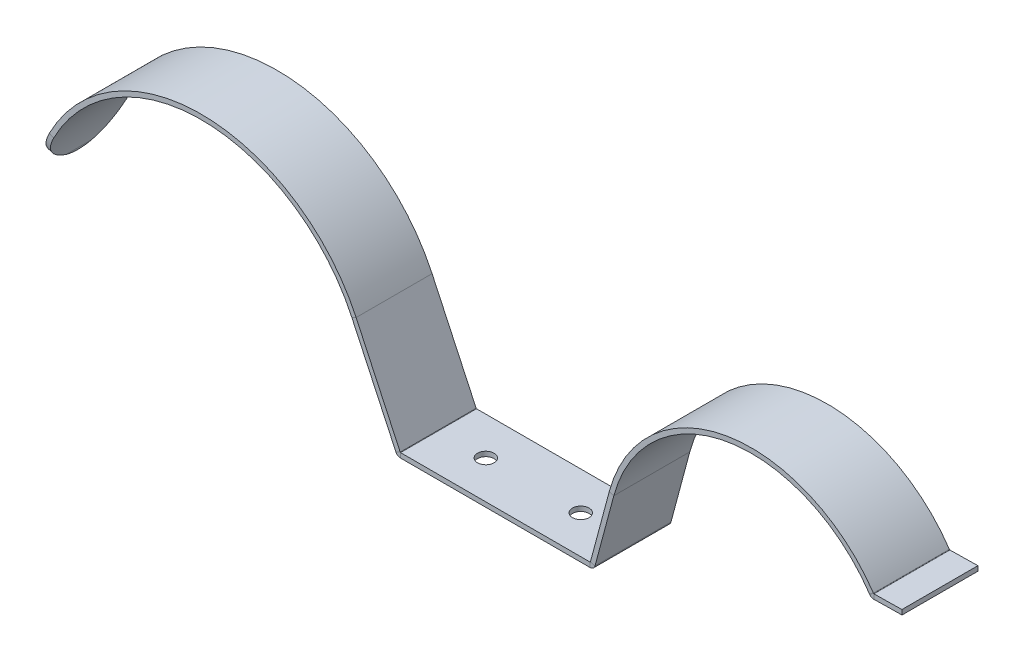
ISO-10303-21;
HEADER;
FILE_DESCRIPTION(('STEP AP214'),'2;1');
FILE_NAME('part.step','',(''),(''),'','','');
FILE_SCHEMA(('AUTOMOTIVE_DESIGN { 1 0 10303 214 1 1 1 1 }'));
ENDSEC;
DATA;
#1=APPLICATION_CONTEXT('core data for automotive mechanical design processes');
#2=APPLICATION_PROTOCOL_DEFINITION('international standard','automotive_design',2000,#1);
#3=PRODUCT_CONTEXT('',#1,'mechanical');
#4=PRODUCT('Part','Part','',(#3));
#5=PRODUCT_RELATED_PRODUCT_CATEGORY('part','',(#4));
#6=PRODUCT_DEFINITION_FORMATION('','',#4);
#7=PRODUCT_DEFINITION_CONTEXT('part definition',#1,'design');
#8=PRODUCT_DEFINITION('design','',#6,#7);
#9=PRODUCT_DEFINITION_SHAPE('','',#8);
#10=(LENGTH_UNIT() NAMED_UNIT(*) SI_UNIT(.MILLI.,.METRE.));
#11=(NAMED_UNIT(*) PLANE_ANGLE_UNIT() SI_UNIT($,.RADIAN.));
#12=(NAMED_UNIT(*) SI_UNIT($,.STERADIAN.) SOLID_ANGLE_UNIT());
#13=UNCERTAINTY_MEASURE_WITH_UNIT(LENGTH_MEASURE(1.E-05),#10,'distance_accuracy_value','');
#14=(GEOMETRIC_REPRESENTATION_CONTEXT(3) GLOBAL_UNCERTAINTY_ASSIGNED_CONTEXT((#13)) GLOBAL_UNIT_ASSIGNED_CONTEXT((#10,
#11,#12)) REPRESENTATION_CONTEXT('',''));
#15=CARTESIAN_POINT('',(0.,0.,0.));
#16=DIRECTION('',(0.,0.,1.));
#17=DIRECTION('',(1.,0.,0.));
#18=AXIS2_PLACEMENT_3D('',#15,#16,#17);
#19=CARTESIAN_POINT('',(56.8219387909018,91.2144847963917,-8.));
#20=DIRECTION('',(0.906307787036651,0.422618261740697,0.));
#21=DIRECTION('',(0.,0.,1.));
#22=AXIS2_PLACEMENT_3D('',#19,#20,#21);
#23=PLANE('',#22);
#24=DIRECTION('',(0.422618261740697,-0.906307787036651,0.));
#25=VECTOR('',#24,1.);
#26=CARTESIAN_POINT('',(56.8219387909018,91.2144847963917,0.));
#27=LINE('',#26,#25);
#28=CARTESIAN_POINT('',(89.7775014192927,20.5410526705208,0.));
#29=VERTEX_POINT('',#28);
#30=CARTESIAN_POINT('',(99.0597903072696,0.63511991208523,0.));
#31=VERTEX_POINT('',#30);
#32=EDGE_CURVE('E421',#29,#31,#27,.T.);
#33=ORIENTED_EDGE('',*,*,#32,.F.);
#34=DIRECTION('',(0.,0.,-1.));
#35=VECTOR('',#34,1.);
#36=CARTESIAN_POINT('',(89.7775014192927,20.5410526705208,-8.));
#37=LINE('',#36,#35);
#38=CARTESIAN_POINT('',(89.7775014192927,20.5410526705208,-16.));
#39=VERTEX_POINT('',#38);
#40=EDGE_CURVE('E76',#29,#39,#37,.T.);
#41=ORIENTED_EDGE('',*,*,#40,.T.);
#42=DIRECTION('',(-0.422618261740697,0.906307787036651,0.));
#43=VECTOR('',#42,1.);
#44=CARTESIAN_POINT('',(56.8219387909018,91.2144847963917,-16.));
#45=LINE('',#44,#43);
#46=CARTESIAN_POINT('',(99.0597903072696,0.63511991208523,-16.));
#47=VERTEX_POINT('',#46);
#48=EDGE_CURVE('E426',#47,#39,#45,.T.);
#49=ORIENTED_EDGE('',*,*,#48,.F.);
#50=DIRECTION('',(0.,0.,1.));
#51=VECTOR('',#50,1.);
#52=CARTESIAN_POINT('',(99.0597903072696,0.63511991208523,-8.));
#53=LINE('',#52,#51);
#54=EDGE_CURVE('E423',#47,#31,#53,.T.);
#55=ORIENTED_EDGE('',*,*,#54,.T.);
#56=EDGE_LOOP('',(#33,#41,#49,#55));
#57=FACE_BOUND('',#56,.T.);
#58=ADVANCED_FACE('F66',(#57),#23,.F.);
#59=CARTESIAN_POINT('',(57.7282465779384,91.6371030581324,0.));
#60=DIRECTION('',(0.,0.,-1.));
#61=DIRECTION('',(-0.422618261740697,0.906307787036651,0.));
#62=AXIS2_PLACEMENT_3D('',#59,#60,#61);
#63=PLANE('',#62);
#64=DIRECTION('',(0.422618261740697,-0.906307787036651,0.));
#65=VECTOR('',#64,1.);
#66=CARTESIAN_POINT('',(57.7282465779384,91.6371030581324,0.));
#67=LINE('',#66,#65);
#68=CARTESIAN_POINT('',(90.6838092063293,20.9636709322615,0.));
#69=VERTEX_POINT('',#68);
#70=CARTESIAN_POINT('',(99.9660980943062,1.05773817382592,0.));
#71=VERTEX_POINT('',#70);
#72=EDGE_CURVE('E430',#69,#71,#67,.T.);
#73=ORIENTED_EDGE('',*,*,#72,.F.);
#74=DIRECTION('',(-0.906307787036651,-0.422618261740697,0.));
#75=VECTOR('',#74,1.);
#76=CARTESIAN_POINT('',(90.6838092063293,20.9636709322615,0.));
#77=LINE('',#76,#75);
#78=EDGE_CURVE('E12',#69,#29,#77,.T.);
#79=ORIENTED_EDGE('',*,*,#78,.T.);
#80=ORIENTED_EDGE('',*,*,#32,.T.);
#81=DIRECTION('',(0.906307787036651,0.422618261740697,0.));
#82=VECTOR('',#81,1.);
#83=CARTESIAN_POINT('',(99.9660980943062,1.05773817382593,0.));
#84=LINE('',#83,#82);
#85=EDGE_CURVE('E461',#31,#71,#84,.T.);
#86=ORIENTED_EDGE('',*,*,#85,.T.);
#87=EDGE_LOOP('',(#73,#79,#80,#86));
#88=FACE_BOUND('',#87,.T.);
#89=ADVANCED_FACE('F410',(#88),#63,.F.);
#90=CARTESIAN_POINT('',(57.7282465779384,91.6371030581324,-16.));
#91=DIRECTION('',(0.,0.,1.));
#92=DIRECTION('',(0.422618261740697,-0.906307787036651,0.));
#93=AXIS2_PLACEMENT_3D('',#90,#91,#92);
#94=PLANE('',#93);
#95=ORIENTED_EDGE('',*,*,#48,.T.);
#96=DIRECTION('',(0.906307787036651,0.422618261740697,0.));
#97=VECTOR('',#96,1.);
#98=CARTESIAN_POINT('',(90.6838092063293,20.9636709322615,-16.));
#99=LINE('',#98,#97);
#100=CARTESIAN_POINT('',(90.6838092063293,20.9636709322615,-16.));
#101=VERTEX_POINT('',#100);
#102=EDGE_CURVE('E441',#39,#101,#99,.T.);
#103=ORIENTED_EDGE('',*,*,#102,.T.);
#104=DIRECTION('',(-0.422618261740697,0.906307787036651,0.));
#105=VECTOR('',#104,1.);
#106=CARTESIAN_POINT('',(57.7282465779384,91.6371030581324,-16.));
#107=LINE('',#106,#105);
#108=CARTESIAN_POINT('',(99.9660980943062,1.05773817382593,-16.));
#109=VERTEX_POINT('',#108);
#110=EDGE_CURVE('E439',#109,#101,#107,.T.);
#111=ORIENTED_EDGE('',*,*,#110,.F.);
#112=DIRECTION('',(-0.906307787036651,-0.422618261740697,0.));
#113=VECTOR('',#112,1.);
#114=CARTESIAN_POINT('',(99.9660980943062,1.05773817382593,-16.));
#115=LINE('',#114,#113);
#116=EDGE_CURVE('E473',#109,#47,#115,.T.);
#117=ORIENTED_EDGE('',*,*,#116,.T.);
#118=EDGE_LOOP('',(#95,#103,#111,#117));
#119=FACE_BOUND('',#118,.T.);
#120=ADVANCED_FACE('F415',(#119),#94,.F.);
#121=CARTESIAN_POINT('',(74.4000738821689,210.831515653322,-16.));
#122=DIRECTION('',(0.,0.,1.));
#123=DIRECTION('',(0.559192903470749,-0.829037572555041,0.));
#124=AXIS2_PLACEMENT_3D('',#121,#122,#123);
#125=PLANE('',#124);
#126=DIRECTION('',(-0.559192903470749,0.829037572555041,0.));
#127=VECTOR('',#126,1.);
#128=CARTESIAN_POINT('',(74.4000738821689,210.831515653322,-16.));
#129=LINE('',#128,#127);
#130=CARTESIAN_POINT('',(199.659284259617,25.1270994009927,-16.0000000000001));
#131=VERTEX_POINT('',#130);
#132=CARTESIAN_POINT('',(199.634708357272,25.1635346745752,-16.0000000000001));
#133=VERTEX_POINT('',#132);
#134=EDGE_CURVE('E449',#131,#133,#129,.T.);
#135=ORIENTED_EDGE('',*,*,#134,.F.);
#136=DIRECTION('',(-0.82903757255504,-0.559192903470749,0.));
#137=VECTOR('',#136,1.);
#138=CARTESIAN_POINT('',(199.659284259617,25.1270994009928,-16.0000000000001));
#139=LINE('',#138,#137);
#140=CARTESIAN_POINT('',(198.830246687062,24.567906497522,-16.0000000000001));
#141=VERTEX_POINT('',#140);
#142=EDGE_CURVE('E442',#131,#141,#139,.T.);
#143=ORIENTED_EDGE('',*,*,#142,.T.);
#144=DIRECTION('',(-0.559192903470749,0.829037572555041,0.));
#145=VECTOR('',#144,1.);
#146=CARTESIAN_POINT('',(73.5710363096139,210.272322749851,-16.));
#147=LINE('',#146,#145);
#148=CARTESIAN_POINT('',(198.805670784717,24.6043417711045,-16.0000000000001));
#149=VERTEX_POINT('',#148);
#150=EDGE_CURVE('E530',#141,#149,#147,.T.);
#151=ORIENTED_EDGE('',*,*,#150,.T.);
#152=DIRECTION('',(0.829037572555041,0.559192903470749,0.));
#153=VECTOR('',#152,1.);
#154=CARTESIAN_POINT('',(199.634708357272,25.1635346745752,-16.0000000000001));
#155=LINE('',#154,#153);
#156=EDGE_CURVE('E532',#149,#133,#155,.T.);
#157=ORIENTED_EDGE('',*,*,#156,.T.);
#158=EDGE_LOOP('',(#135,#143,#151,#157));
#159=FACE_BOUND('',#158,.T.);
#160=ADVANCED_FACE('F699',(#159),#125,.F.);
#161=CARTESIAN_POINT('',(73.5710363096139,210.272322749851,-8.));
#162=DIRECTION('',(0.829037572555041,0.559192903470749,0.));
#163=DIRECTION('',(0.,0.,1.));
#164=AXIS2_PLACEMENT_3D('',#161,#162,#163);
#165=PLANE('',#164);
#166=ORIENTED_EDGE('',*,*,#150,.F.);
#167=DIRECTION('',(0.,0.,1.));
#168=VECTOR('',#167,1.);
#169=CARTESIAN_POINT('',(198.830246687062,24.567906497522,-8.));
#170=LINE('',#169,#168);
#171=CARTESIAN_POINT('',(198.830246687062,24.5679064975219,0.));
#172=VERTEX_POINT('',#171);
#173=EDGE_CURVE('E446',#141,#172,#170,.T.);
#174=ORIENTED_EDGE('',*,*,#173,.T.);
#175=DIRECTION('',(0.559192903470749,-0.829037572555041,0.));
#176=VECTOR('',#175,1.);
#177=CARTESIAN_POINT('',(73.5710363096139,210.272322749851,0.));
#178=LINE('',#177,#176);
#179=CARTESIAN_POINT('',(198.805670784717,24.6043417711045,0.));
#180=VERTEX_POINT('',#179);
#181=EDGE_CURVE('E534',#180,#172,#178,.T.);
#182=ORIENTED_EDGE('',*,*,#181,.F.);
#183=DIRECTION('',(0.,0.,-1.));
#184=VECTOR('',#183,1.);
#185=CARTESIAN_POINT('',(198.805670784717,24.6043417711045,-8.));
#186=LINE('',#185,#184);
#187=EDGE_CURVE('E533',#180,#149,#186,.T.);
#188=ORIENTED_EDGE('',*,*,#187,.T.);
#189=EDGE_LOOP('',(#166,#174,#182,#188));
#190=FACE_BOUND('',#189,.T.);
#191=ADVANCED_FACE('F695',(#190),#165,.F.);
#192=CARTESIAN_POINT('',(74.4000738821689,210.831515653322,0.));
#193=DIRECTION('',(0.,0.,-1.));
#194=DIRECTION('',(-0.559192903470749,0.829037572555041,0.));
#195=AXIS2_PLACEMENT_3D('',#192,#193,#194);
#196=PLANE('',#195);
#197=ORIENTED_EDGE('',*,*,#181,.T.);
#198=DIRECTION('',(0.82903757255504,0.559192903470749,0.));
#199=VECTOR('',#198,1.);
#200=CARTESIAN_POINT('',(199.659284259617,25.1270994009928,0.));
#201=LINE('',#200,#199);
#202=CARTESIAN_POINT('',(199.659284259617,25.1270994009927,0.));
#203=VERTEX_POINT('',#202);
#204=EDGE_CURVE('E525',#172,#203,#201,.T.);
#205=ORIENTED_EDGE('',*,*,#204,.T.);
#206=DIRECTION('',(0.559192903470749,-0.829037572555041,0.));
#207=VECTOR('',#206,1.);
#208=CARTESIAN_POINT('',(74.4000738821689,210.831515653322,0.));
#209=LINE('',#208,#207);
#210=CARTESIAN_POINT('',(199.634708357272,25.1635346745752,0.));
#211=VERTEX_POINT('',#210);
#212=EDGE_CURVE('E537',#211,#203,#209,.T.);
#213=ORIENTED_EDGE('',*,*,#212,.F.);
#214=DIRECTION('',(-0.829037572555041,-0.559192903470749,0.));
#215=VECTOR('',#214,1.);
#216=CARTESIAN_POINT('',(199.634708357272,25.1635346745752,0.));
#217=LINE('',#216,#215);
#218=EDGE_CURVE('E536',#211,#180,#217,.T.);
#219=ORIENTED_EDGE('',*,*,#218,.T.);
#220=EDGE_LOOP('',(#197,#205,#213,#219));
#221=FACE_BOUND('',#220,.T.);
#222=ADVANCED_FACE('F676',(#221),#196,.F.);
#223=CARTESIAN_POINT('',(103.779528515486,-134.218723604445,-8.));
#224=DIRECTION('',(-0.965925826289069,0.258819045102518,0.));
#225=DIRECTION('',(0.,0.,1.));
#226=AXIS2_PLACEMENT_3D('',#223,#224,#225);
#227=PLANE('',#226);
#228=DIRECTION('',(0.258819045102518,0.965925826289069,0.));
#229=VECTOR('',#228,1.);
#230=CARTESIAN_POINT('',(103.779528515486,-134.218723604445,0.));
#231=LINE('',#230,#229);
#232=CARTESIAN_POINT('',(140.031136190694,1.07411809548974,0.));
#233=VERTEX_POINT('',#232);
#234=CARTESIAN_POINT('',(143.990842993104,15.85194506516,0.));
#235=VERTEX_POINT('',#234);
#236=EDGE_CURVE('E518',#233,#235,#231,.T.);
#237=ORIENTED_EDGE('',*,*,#236,.T.);
#238=DIRECTION('',(0.,0.,-1.));
#239=VECTOR('',#238,1.);
#240=CARTESIAN_POINT('',(143.990842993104,15.8519450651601,-8.));
#241=LINE('',#240,#239);
#242=CARTESIAN_POINT('',(143.990842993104,15.8519450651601,-16.));
#243=VERTEX_POINT('',#242);
#244=EDGE_CURVE('E487',#235,#243,#241,.T.);
#245=ORIENTED_EDGE('',*,*,#244,.T.);
#246=DIRECTION('',(-0.258819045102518,-0.965925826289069,0.));
#247=VECTOR('',#246,1.);
#248=CARTESIAN_POINT('',(103.779528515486,-134.218723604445,-16.));
#249=LINE('',#248,#247);
#250=CARTESIAN_POINT('',(140.031136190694,1.07411809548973,-16.));
#251=VERTEX_POINT('',#250);
#252=EDGE_CURVE('E519',#243,#251,#249,.T.);
#253=ORIENTED_EDGE('',*,*,#252,.T.);
#254=DIRECTION('',(0.,0.,1.));
#255=VECTOR('',#254,1.);
#256=CARTESIAN_POINT('',(140.031136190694,1.07411809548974,-8.));
#257=LINE('',#256,#255);
#258=EDGE_CURVE('E521',#251,#233,#257,.T.);
#259=ORIENTED_EDGE('',*,*,#258,.T.);
#260=EDGE_LOOP('',(#237,#245,#253,#259));
#261=FACE_BOUND('',#260,.T.);
#262=ADVANCED_FACE('F645',(#261),#227,.T.);
#263=CARTESIAN_POINT('',(0.,1.,-16.));
#264=DIRECTION('',(0.,0.,1.));
#265=DIRECTION('',(1.,0.,0.));
#266=AXIS2_PLACEMENT_3D('',#263,#264,#265);
#267=PLANE('',#266);
#268=DIRECTION('',(-1.,0.,0.));
#269=VECTOR('',#268,1.);
#270=CARTESIAN_POINT('',(0.,1.,-16.));
#271=LINE('',#270,#269);
#272=CARTESIAN_POINT('',(139.934543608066,1.,-16.));
#273=VERTEX_POINT('',#272);
#274=CARTESIAN_POINT('',(100.05672887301,1.,-16.));
#275=VERTEX_POINT('',#274);
#276=EDGE_CURVE('E498',#273,#275,#271,.T.);
#277=ORIENTED_EDGE('',*,*,#276,.F.);
#278=DIRECTION('',(0.,-1.,0.));
#279=VECTOR('',#278,1.);
#280=CARTESIAN_POINT('',(139.934543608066,1.,-16.0000000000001));
#281=LINE('',#280,#279);
#282=CARTESIAN_POINT('',(139.934543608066,0.,-16.0000000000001));
#283=VERTEX_POINT('',#282);
#284=EDGE_CURVE('E484',#273,#283,#281,.T.);
#285=ORIENTED_EDGE('',*,*,#284,.T.);
#286=DIRECTION('',(-1.,0.,0.));
#287=VECTOR('',#286,1.);
#288=CARTESIAN_POINT('',(0.,0.,-16.));
#289=LINE('',#288,#287);
#290=CARTESIAN_POINT('',(100.05672887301,0.,-16.));
#291=VERTEX_POINT('',#290);
#292=EDGE_CURVE('E427',#283,#291,#289,.T.);
#293=ORIENTED_EDGE('',*,*,#292,.T.);
#294=DIRECTION('',(0.,-1.,0.));
#295=VECTOR('',#294,1.);
#296=CARTESIAN_POINT('',(100.05672887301,1.,-16.));
#297=LINE('',#296,#295);
#298=EDGE_CURVE('E469',#275,#291,#297,.T.);
#299=ORIENTED_EDGE('',*,*,#298,.F.);
#300=EDGE_LOOP('',(#277,#285,#293,#299));
#301=FACE_BOUND('',#300,.T.);
#302=ADVANCED_FACE('F632',(#301),#267,.F.);
#303=CARTESIAN_POINT('',(0.,0.,-8.));
#304=DIRECTION('',(0.,1.,0.));
#305=DIRECTION('',(0.,0.,1.));
#306=AXIS2_PLACEMENT_3D('',#303,#304,#305);
#307=PLANE('',#306);
#308=CARTESIAN_POINT('',(130.,0.,-8.00000000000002));
#309=DIRECTION('',(0.,1.,0.));
#310=DIRECTION('',(0.,0.,1.));
#311=AXIS2_PLACEMENT_3D('',#308,#309,#310);
#312=CIRCLE('',#311,1.75000000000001);
#313=CARTESIAN_POINT('',(130.,0.,-6.25000000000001));
#314=VERTEX_POINT('',#313);
#315=EDGE_CURVE('E489',#314,#314,#312,.T.);
#316=ORIENTED_EDGE('',*,*,#315,.T.);
#317=EDGE_LOOP('',(#316));
#318=FACE_BOUND('',#317,.T.);
#319=CARTESIAN_POINT('',(110.,0.,-8.00000000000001));
#320=DIRECTION('',(0.,1.,0.));
#321=DIRECTION('',(0.,0.,1.));
#322=AXIS2_PLACEMENT_3D('',#319,#320,#321);
#323=CIRCLE('',#322,1.75);
#324=CARTESIAN_POINT('',(110.,0.,-6.25000000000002));
#325=VERTEX_POINT('',#324);
#326=EDGE_CURVE('E493',#325,#325,#323,.T.);
#327=ORIENTED_EDGE('',*,*,#326,.T.);
#328=EDGE_LOOP('',(#327));
#329=FACE_BOUND('',#328,.T.);
#330=ORIENTED_EDGE('',*,*,#292,.F.);
#331=DIRECTION('',(0.,0.,1.));
#332=VECTOR('',#331,1.);
#333=CARTESIAN_POINT('',(139.934543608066,0.,-8.));
#334=LINE('',#333,#332);
#335=CARTESIAN_POINT('',(139.934543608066,0.,0.));
#336=VERTEX_POINT('',#335);
#337=EDGE_CURVE('E481',#283,#336,#334,.T.);
#338=ORIENTED_EDGE('',*,*,#337,.T.);
#339=DIRECTION('',(1.,0.,0.));
#340=VECTOR('',#339,1.);
#341=CARTESIAN_POINT('',(0.,0.,0.));
#342=LINE('',#341,#340);
#343=CARTESIAN_POINT('',(100.05672887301,0.,0.));
#344=VERTEX_POINT('',#343);
#345=EDGE_CURVE('E490',#344,#336,#342,.T.);
#346=ORIENTED_EDGE('',*,*,#345,.F.);
#347=DIRECTION('',(0.,0.,1.));
#348=VECTOR('',#347,1.);
#349=CARTESIAN_POINT('',(100.05672887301,0.,-8.));
#350=LINE('',#349,#348);
#351=EDGE_CURVE('E608',#291,#344,#350,.T.);
#352=ORIENTED_EDGE('',*,*,#351,.F.);
#353=EDGE_LOOP('',(#330,#338,#346,#352));
#354=FACE_BOUND('',#353,.T.);
#355=ADVANCED_FACE('F661',(#318,#329,#354),#307,.F.);
#356=CARTESIAN_POINT('',(0.,1.,0.));
#357=DIRECTION('',(0.,0.,-1.));
#358=DIRECTION('',(-1.,0.,0.));
#359=AXIS2_PLACEMENT_3D('',#356,#357,#358);
#360=PLANE('',#359);
#361=ORIENTED_EDGE('',*,*,#345,.T.);
#362=DIRECTION('',(0.,1.,0.));
#363=VECTOR('',#362,1.);
#364=CARTESIAN_POINT('',(139.934543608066,1.,0.));
#365=LINE('',#364,#363);
#366=CARTESIAN_POINT('',(139.934543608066,1.,0.));
#367=VERTEX_POINT('',#366);
#368=EDGE_CURVE('E478',#336,#367,#365,.T.);
#369=ORIENTED_EDGE('',*,*,#368,.T.);
#370=DIRECTION('',(1.,0.,0.));
#371=VECTOR('',#370,1.);
#372=CARTESIAN_POINT('',(0.,1.,0.));
#373=LINE('',#372,#371);
#374=CARTESIAN_POINT('',(100.05672887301,1.,0.));
#375=VERTEX_POINT('',#374);
#376=EDGE_CURVE('E494',#375,#367,#373,.T.);
#377=ORIENTED_EDGE('',*,*,#376,.F.);
#378=DIRECTION('',(0.,1.,0.));
#379=VECTOR('',#378,1.);
#380=CARTESIAN_POINT('',(100.05672887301,1.,0.));
#381=LINE('',#380,#379);
#382=EDGE_CURVE('E606',#344,#375,#381,.T.);
#383=ORIENTED_EDGE('',*,*,#382,.F.);
#384=EDGE_LOOP('',(#361,#369,#377,#383));
#385=FACE_BOUND('',#384,.T.);
#386=ADVANCED_FACE('F659',(#385),#360,.F.);
#387=CARTESIAN_POINT('',(57.7282465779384,91.6371030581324,-8.));
#388=DIRECTION('',(0.906307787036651,0.422618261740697,0.));
#389=DIRECTION('',(0.,0.,1.));
#390=AXIS2_PLACEMENT_3D('',#387,#388,#389);
#391=PLANE('',#390);
#392=DIRECTION('',(0.,0.,-1.));
#393=VECTOR('',#392,1.);
#394=CARTESIAN_POINT('',(90.6838092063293,20.9636709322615,-8.));
#395=LINE('',#394,#393);
#396=EDGE_CURVE('E433',#69,#101,#395,.T.);
#397=ORIENTED_EDGE('',*,*,#396,.F.);
#398=ORIENTED_EDGE('',*,*,#72,.T.);
#399=DIRECTION('',(0.,0.,1.));
#400=VECTOR('',#399,1.);
#401=CARTESIAN_POINT('',(99.9660980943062,1.05773817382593,-8.));
#402=LINE('',#401,#400);
#403=EDGE_CURVE('E456',#109,#71,#402,.T.);
#404=ORIENTED_EDGE('',*,*,#403,.F.);
#405=ORIENTED_EDGE('',*,*,#110,.T.);
#406=EDGE_LOOP('',(#397,#398,#404,#405));
#407=FACE_BOUND('',#406,.T.);
#408=ADVANCED_FACE('F437',(#407),#391,.T.);
#409=CARTESIAN_POINT('',(130.,1.,-8.00000000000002));
#410=DIRECTION('',(0.,-1.,0.));
#411=DIRECTION('',(0.,0.,-1.));
#412=AXIS2_PLACEMENT_3D('',#409,#410,#411);
#413=CYLINDRICAL_SURFACE('',#412,1.75000000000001);
#414=CARTESIAN_POINT('',(130.,1.,-8.00000000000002));
#415=DIRECTION('',(0.,1.,0.));
#416=DIRECTION('',(0.,0.,1.));
#417=AXIS2_PLACEMENT_3D('',#414,#415,#416);
#418=CIRCLE('',#417,1.75000000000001);
#419=CARTESIAN_POINT('',(130.,1.,-6.25000000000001));
#420=VERTEX_POINT('',#419);
#421=EDGE_CURVE('E603',#420,#420,#418,.T.);
#422=ORIENTED_EDGE('',*,*,#421,.T.);
#423=EDGE_LOOP('',(#422));
#424=FACE_BOUND('',#423,.T.);
#425=ORIENTED_EDGE('',*,*,#315,.F.);
#426=EDGE_LOOP('',(#425));
#427=FACE_BOUND('',#426,.T.);
#428=ADVANCED_FACE('F707',(#424,#427),#413,.F.);
#429=CARTESIAN_POINT('',(110.,1.,-8.00000000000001));
#430=DIRECTION('',(0.,-1.,0.));
#431=DIRECTION('',(0.,0.,-1.));
#432=AXIS2_PLACEMENT_3D('',#429,#430,#431);
#433=CYLINDRICAL_SURFACE('',#432,1.75);
#434=CARTESIAN_POINT('',(110.,1.,-8.00000000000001));
#435=DIRECTION('',(0.,1.,0.));
#436=DIRECTION('',(0.,0.,1.));
#437=AXIS2_PLACEMENT_3D('',#434,#435,#436);
#438=CIRCLE('',#437,1.75);
#439=CARTESIAN_POINT('',(110.,1.,-6.25000000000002));
#440=VERTEX_POINT('',#439);
#441=EDGE_CURVE('E500',#440,#440,#438,.T.);
#442=ORIENTED_EDGE('',*,*,#441,.T.);
#443=EDGE_LOOP('',(#442));
#444=FACE_BOUND('',#443,.T.);
#445=ORIENTED_EDGE('',*,*,#326,.F.);
#446=EDGE_LOOP('',(#445));
#447=FACE_BOUND('',#446,.T.);
#448=ADVANCED_FACE('F711',(#444,#447),#433,.F.);
#449=CARTESIAN_POINT('',(0.,1.,-8.));
#450=DIRECTION('',(0.,1.,0.));
#451=DIRECTION('',(0.,0.,1.));
#452=AXIS2_PLACEMENT_3D('',#449,#450,#451);
#453=PLANE('',#452);
#454=DIRECTION('',(0.,0.,1.));
#455=VECTOR('',#454,1.);
#456=CARTESIAN_POINT('',(139.934543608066,1.,-8.));
#457=LINE('',#456,#455);
#458=EDGE_CURVE('E476',#273,#367,#457,.T.);
#459=ORIENTED_EDGE('',*,*,#458,.F.);
#460=ORIENTED_EDGE('',*,*,#276,.T.);
#461=DIRECTION('',(0.,0.,1.));
#462=VECTOR('',#461,1.);
#463=CARTESIAN_POINT('',(100.05672887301,1.,-8.));
#464=LINE('',#463,#462);
#465=EDGE_CURVE('E497',#275,#375,#464,.T.);
#466=ORIENTED_EDGE('',*,*,#465,.T.);
#467=ORIENTED_EDGE('',*,*,#376,.T.);
#468=EDGE_LOOP('',(#459,#460,#466,#467));
#469=FACE_BOUND('',#468,.T.);
#470=ORIENTED_EDGE('',*,*,#441,.F.);
#471=EDGE_LOOP('',(#470));
#472=FACE_BOUND('',#471,.T.);
#473=ORIENTED_EDGE('',*,*,#421,.F.);
#474=EDGE_LOOP('',(#473));
#475=FACE_BOUND('',#474,.T.);
#476=ADVANCED_FACE('F630',(#469,#472,#475),#453,.T.);
#477=CARTESIAN_POINT('',(100.05672887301,1.1,-16.));
#478=DIRECTION('',(0.,0.,1.));
#479=DIRECTION('',(1.,0.,0.));
#480=AXIS2_PLACEMENT_3D('',#477,#478,#479);
#481=PLANE('',#480);
#482=ORIENTED_EDGE('',*,*,#298,.T.);
#483=CARTESIAN_POINT('',(100.05672887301,1.1,-16.));
#484=DIRECTION('',(0.,0.,1.));
#485=DIRECTION('',(1.,0.,0.));
#486=AXIS2_PLACEMENT_3D('',#483,#484,#485);
#487=CIRCLE('',#486,1.1);
#488=EDGE_CURVE('E582',#291,#47,#487,.F.);
#489=ORIENTED_EDGE('',*,*,#488,.T.);
#490=ORIENTED_EDGE('',*,*,#116,.F.);
#491=CARTESIAN_POINT('',(100.05672887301,1.1,-16.));
#492=DIRECTION('',(0.,0.,-1.));
#493=DIRECTION('',(-1.,0.,0.));
#494=AXIS2_PLACEMENT_3D('',#491,#492,#493);
#495=CIRCLE('',#494,0.100000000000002);
#496=EDGE_CURVE('E586',#275,#109,#495,.T.);
#497=ORIENTED_EDGE('',*,*,#496,.F.);
#498=EDGE_LOOP('',(#482,#489,#490,#497));
#499=FACE_BOUND('',#498,.T.);
#500=ADVANCED_FACE('F618',(#499),#481,.F.);
#501=CARTESIAN_POINT('',(100.05672887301,1.1,0.));
#502=DIRECTION('',(0.,0.,-1.));
#503=DIRECTION('',(-1.,0.,0.));
#504=AXIS2_PLACEMENT_3D('',#501,#502,#503);
#505=PLANE('',#504);
#506=CARTESIAN_POINT('',(100.05672887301,1.1,0.));
#507=DIRECTION('',(0.,0.,1.));
#508=DIRECTION('',(1.,0.,0.));
#509=AXIS2_PLACEMENT_3D('',#506,#507,#508);
#510=CIRCLE('',#509,1.1);
#511=EDGE_CURVE('E589',#31,#344,#510,.T.);
#512=ORIENTED_EDGE('',*,*,#511,.T.);
#513=ORIENTED_EDGE('',*,*,#382,.T.);
#514=CARTESIAN_POINT('',(100.05672887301,1.1,0.));
#515=DIRECTION('',(0.,0.,1.));
#516=DIRECTION('',(1.,0.,0.));
#517=AXIS2_PLACEMENT_3D('',#514,#515,#516);
#518=CIRCLE('',#517,0.100000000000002);
#519=EDGE_CURVE('E588',#71,#375,#518,.T.);
#520=ORIENTED_EDGE('',*,*,#519,.F.);
#521=ORIENTED_EDGE('',*,*,#85,.F.);
#522=EDGE_LOOP('',(#512,#513,#520,#521));
#523=FACE_BOUND('',#522,.T.);
#524=ADVANCED_FACE('F625',(#523),#505,.F.);
#525=CARTESIAN_POINT('',(100.05672887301,1.1,-24.0316210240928));
#526=DIRECTION('',(0.,0.,1.));
#527=DIRECTION('',(1.,0.,0.));
#528=AXIS2_PLACEMENT_3D('',#525,#526,#527);
#529=CYLINDRICAL_SURFACE('',#528,0.1);
#530=ORIENTED_EDGE('',*,*,#403,.T.);
#531=ORIENTED_EDGE('',*,*,#519,.T.);
#532=ORIENTED_EDGE('',*,*,#465,.F.);
#533=ORIENTED_EDGE('',*,*,#496,.T.);
#534=EDGE_LOOP('',(#530,#531,#532,#533));
#535=FACE_BOUND('',#534,.T.);
#536=ADVANCED_FACE('F627',(#535),#529,.F.);
#537=CARTESIAN_POINT('',(100.05672887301,1.1,-24.0316210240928));
#538=DIRECTION('',(0.,0.,1.));
#539=DIRECTION('',(1.,0.,0.));
#540=AXIS2_PLACEMENT_3D('',#537,#538,#539);
#541=CYLINDRICAL_SURFACE('',#540,1.1);
#542=ORIENTED_EDGE('',*,*,#54,.F.);
#543=ORIENTED_EDGE('',*,*,#488,.F.);
#544=ORIENTED_EDGE('',*,*,#351,.T.);
#545=ORIENTED_EDGE('',*,*,#511,.F.);
#546=EDGE_LOOP('',(#542,#543,#544,#545));
#547=FACE_BOUND('',#546,.T.);
#548=ADVANCED_FACE('F623',(#547),#541,.T.);
#549=CARTESIAN_POINT('',(139.934543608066,1.1,-16.));
#550=DIRECTION('',(0.,0.,1.));
#551=DIRECTION('',(1.,0.,0.));
#552=AXIS2_PLACEMENT_3D('',#549,#550,#551);
#553=PLANE('',#552);
#554=DIRECTION('',(0.965925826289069,-0.258819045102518,0.));
#555=VECTOR('',#554,1.);
#556=CARTESIAN_POINT('',(140.031136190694,1.07411809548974,-16.0000000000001));
#557=LINE('',#556,#555);
#558=CARTESIAN_POINT('',(140.997062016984,0.815299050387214,-16.0000000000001));
#559=VERTEX_POINT('',#558);
#560=EDGE_CURVE('E561',#251,#559,#557,.T.);
#561=ORIENTED_EDGE('',*,*,#560,.T.);
#562=CARTESIAN_POINT('',(139.934543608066,1.1,-16.));
#563=DIRECTION('',(0.,0.,-1.));
#564=DIRECTION('',(-1.,0.,0.));
#565=AXIS2_PLACEMENT_3D('',#562,#563,#564);
#566=CIRCLE('',#565,1.1);
#567=EDGE_CURVE('E515',#559,#283,#566,.T.);
#568=ORIENTED_EDGE('',*,*,#567,.T.);
#569=ORIENTED_EDGE('',*,*,#284,.F.);
#570=CARTESIAN_POINT('',(139.934543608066,1.1,-16.));
#571=DIRECTION('',(0.,0.,-1.));
#572=DIRECTION('',(-1.,0.,0.));
#573=AXIS2_PLACEMENT_3D('',#570,#571,#572);
#574=CIRCLE('',#573,0.0999999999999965);
#575=EDGE_CURVE('E575',#251,#273,#574,.T.);
#576=ORIENTED_EDGE('',*,*,#575,.F.);
#577=EDGE_LOOP('',(#561,#568,#569,#576));
#578=FACE_BOUND('',#577,.T.);
#579=ADVANCED_FACE('F636',(#578),#553,.F.);
#580=CARTESIAN_POINT('',(139.934543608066,1.1,0.));
#581=DIRECTION('',(0.,0.,-1.));
#582=DIRECTION('',(-1.,0.,0.));
#583=AXIS2_PLACEMENT_3D('',#580,#581,#582);
#584=PLANE('',#583);
#585=CARTESIAN_POINT('',(139.934543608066,1.1,0.));
#586=DIRECTION('',(0.,0.,-1.));
#587=DIRECTION('',(-1.,0.,0.));
#588=AXIS2_PLACEMENT_3D('',#585,#586,#587);
#589=CIRCLE('',#588,1.1);
#590=CARTESIAN_POINT('',(140.997062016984,0.815299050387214,0.));
#591=VERTEX_POINT('',#590);
#592=EDGE_CURVE('E579',#336,#591,#589,.F.);
#593=ORIENTED_EDGE('',*,*,#592,.T.);
#594=DIRECTION('',(-0.965925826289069,0.258819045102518,0.));
#595=VECTOR('',#594,1.);
#596=CARTESIAN_POINT('',(140.031136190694,1.07411809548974,0.));
#597=LINE('',#596,#595);
#598=EDGE_CURVE('E522',#591,#233,#597,.T.);
#599=ORIENTED_EDGE('',*,*,#598,.T.);
#600=CARTESIAN_POINT('',(139.934543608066,1.1,0.));
#601=DIRECTION('',(0.,0.,1.));
#602=DIRECTION('',(1.,0.,0.));
#603=AXIS2_PLACEMENT_3D('',#600,#601,#602);
#604=CIRCLE('',#603,0.0999999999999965);
#605=EDGE_CURVE('E578',#367,#233,#604,.T.);
#606=ORIENTED_EDGE('',*,*,#605,.F.);
#607=ORIENTED_EDGE('',*,*,#368,.F.);
#608=EDGE_LOOP('',(#593,#599,#606,#607));
#609=FACE_BOUND('',#608,.T.);
#610=ADVANCED_FACE('F653',(#609),#584,.F.);
#611=CARTESIAN_POINT('',(139.934543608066,1.1,8.03175405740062));
#612=DIRECTION('',(0.,0.,-1.));
#613=DIRECTION('',(-1.,0.,0.));
#614=AXIS2_PLACEMENT_3D('',#611,#612,#613);
#615=CYLINDRICAL_SURFACE('',#614,0.1);
#616=ORIENTED_EDGE('',*,*,#458,.T.);
#617=ORIENTED_EDGE('',*,*,#605,.T.);
#618=ORIENTED_EDGE('',*,*,#258,.F.);
#619=ORIENTED_EDGE('',*,*,#575,.T.);
#620=EDGE_LOOP('',(#616,#617,#618,#619));
#621=FACE_BOUND('',#620,.T.);
#622=ADVANCED_FACE('F641',(#621),#615,.F.);
#623=CARTESIAN_POINT('',(139.934543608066,1.1,8.03175405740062));
#624=DIRECTION('',(0.,0.,-1.));
#625=DIRECTION('',(-1.,0.,0.));
#626=AXIS2_PLACEMENT_3D('',#623,#624,#625);
#627=CYLINDRICAL_SURFACE('',#626,1.1);
#628=ORIENTED_EDGE('',*,*,#337,.F.);
#629=ORIENTED_EDGE('',*,*,#567,.F.);
#630=DIRECTION('',(0.,0.,1.));
#631=VECTOR('',#630,1.);
#632=CARTESIAN_POINT('',(140.997062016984,0.815299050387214,-8.));
#633=LINE('',#632,#631);
#634=EDGE_CURVE('E570',#559,#591,#633,.T.);
#635=ORIENTED_EDGE('',*,*,#634,.T.);
#636=ORIENTED_EDGE('',*,*,#592,.F.);
#637=EDGE_LOOP('',(#628,#629,#635,#636));
#638=FACE_BOUND('',#637,.T.);
#639=ADVANCED_FACE('F656',(#638),#627,.T.);
#640=CARTESIAN_POINT('',(103.779528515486,-134.218723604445,0.));
#641=DIRECTION('',(0.,0.,-1.));
#642=DIRECTION('',(-0.258819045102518,-0.965925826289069,0.));
#643=AXIS2_PLACEMENT_3D('',#640,#641,#642);
#644=PLANE('',#643);
#645=DIRECTION('',(0.965925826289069,-0.258819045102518,0.));
#646=VECTOR('',#645,1.);
#647=CARTESIAN_POINT('',(143.990842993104,15.8519450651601,0.));
#648=LINE('',#647,#646);
#649=CARTESIAN_POINT('',(144.956768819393,15.5931260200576,0.));
#650=VERTEX_POINT('',#649);
#651=EDGE_CURVE('E503',#235,#650,#648,.T.);
#652=ORIENTED_EDGE('',*,*,#651,.F.);
#653=ORIENTED_EDGE('',*,*,#236,.F.);
#654=ORIENTED_EDGE('',*,*,#598,.F.);
#655=DIRECTION('',(0.258819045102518,0.965925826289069,0.));
#656=VECTOR('',#655,1.);
#657=CARTESIAN_POINT('',(104.745454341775,-134.477542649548,0.));
#658=LINE('',#657,#656);
#659=EDGE_CURVE('E516',#591,#650,#658,.T.);
#660=ORIENTED_EDGE('',*,*,#659,.T.);
#661=EDGE_LOOP('',(#652,#653,#654,#660));
#662=FACE_BOUND('',#661,.T.);
#663=ADVANCED_FACE('F650',(#662),#644,.F.);
#664=CARTESIAN_POINT('',(104.745454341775,-134.477542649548,-8.));
#665=DIRECTION('',(-0.965925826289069,0.258819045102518,0.));
#666=DIRECTION('',(0.,0.,1.));
#667=AXIS2_PLACEMENT_3D('',#664,#665,#666);
#668=PLANE('',#667);
#669=DIRECTION('',(0.,0.,-1.));
#670=VECTOR('',#669,1.);
#671=CARTESIAN_POINT('',(144.956768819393,15.5931260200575,-8.));
#672=LINE('',#671,#670);
#673=CARTESIAN_POINT('',(144.956768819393,15.5931260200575,-16.0000000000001));
#674=VERTEX_POINT('',#673);
#675=EDGE_CURVE('E506',#650,#674,#672,.T.);
#676=ORIENTED_EDGE('',*,*,#675,.F.);
#677=ORIENTED_EDGE('',*,*,#659,.F.);
#678=ORIENTED_EDGE('',*,*,#634,.F.);
#679=DIRECTION('',(-0.258819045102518,-0.965925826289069,0.));
#680=VECTOR('',#679,1.);
#681=CARTESIAN_POINT('',(104.745454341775,-134.477542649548,-16.));
#682=LINE('',#681,#680);
#683=EDGE_CURVE('E513',#674,#559,#682,.T.);
#684=ORIENTED_EDGE('',*,*,#683,.F.);
#685=EDGE_LOOP('',(#676,#677,#678,#684));
#686=FACE_BOUND('',#685,.T.);
#687=ADVANCED_FACE('F679',(#686),#668,.F.);
#688=CARTESIAN_POINT('',(103.779528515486,-134.218723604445,-16.));
#689=DIRECTION('',(0.,0.,1.));
#690=DIRECTION('',(0.258819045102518,0.965925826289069,0.));
#691=AXIS2_PLACEMENT_3D('',#688,#689,#690);
#692=PLANE('',#691);
#693=DIRECTION('',(-0.965925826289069,0.258819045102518,0.));
#694=VECTOR('',#693,1.);
#695=CARTESIAN_POINT('',(143.990842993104,15.8519450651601,-16.0000000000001));
#696=LINE('',#695,#694);
#697=EDGE_CURVE('E509',#674,#243,#696,.T.);
#698=ORIENTED_EDGE('',*,*,#697,.F.);
#699=ORIENTED_EDGE('',*,*,#683,.T.);
#700=ORIENTED_EDGE('',*,*,#560,.F.);
#701=ORIENTED_EDGE('',*,*,#252,.F.);
#702=EDGE_LOOP('',(#698,#699,#700,#701));
#703=FACE_BOUND('',#702,.T.);
#704=ADVANCED_FACE('F682',(#703),#692,.F.);
#705=CARTESIAN_POINT('',(173.934543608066,7.82855466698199,0.));
#706=DIRECTION('',(0.,0.,1.));
#707=DIRECTION('',(1.,0.,0.));
#708=AXIS2_PLACEMENT_3D('',#705,#706,#707);
#709=PLANE('',#708);
#710=ORIENTED_EDGE('',*,*,#651,.T.);
#711=CARTESIAN_POINT('',(173.934543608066,7.82855466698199,0.));
#712=DIRECTION('',(0.,0.,-1.));
#713=DIRECTION('',(-1.,0.,0.));
#714=AXIS2_PLACEMENT_3D('',#711,#712,#713);
#715=CIRCLE('',#714,30.);
#716=EDGE_CURVE('E564',#650,#180,#715,.T.);
#717=ORIENTED_EDGE('',*,*,#716,.T.);
#718=ORIENTED_EDGE('',*,*,#218,.F.);
#719=CARTESIAN_POINT('',(173.934543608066,7.82855466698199,0.));
#720=DIRECTION('',(0.,0.,-1.));
#721=DIRECTION('',(-1.,0.,0.));
#722=AXIS2_PLACEMENT_3D('',#719,#720,#721);
#723=CIRCLE('',#722,31.);
#724=EDGE_CURVE('E556',#235,#211,#723,.T.);
#725=ORIENTED_EDGE('',*,*,#724,.F.);
#726=EDGE_LOOP('',(#710,#717,#718,#725));
#727=FACE_BOUND('',#726,.T.);
#728=ADVANCED_FACE('F686',(#727),#709,.T.);
#729=CARTESIAN_POINT('',(173.934543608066,7.82855466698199,-16.0000000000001));
#730=DIRECTION('',(0.,0.,-1.));
#731=DIRECTION('',(0.,1.,0.));
#732=AXIS2_PLACEMENT_3D('',#729,#730,#731);
#733=PLANE('',#732);
#734=ORIENTED_EDGE('',*,*,#156,.F.);
#735=CARTESIAN_POINT('',(173.934543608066,7.82855466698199,-16.0000000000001));
#736=DIRECTION('',(0.,0.,-1.));
#737=DIRECTION('',(-1.,0.,0.));
#738=AXIS2_PLACEMENT_3D('',#735,#736,#737);
#739=CIRCLE('',#738,30.);
#740=EDGE_CURVE('E559',#149,#674,#739,.F.);
#741=ORIENTED_EDGE('',*,*,#740,.T.);
#742=ORIENTED_EDGE('',*,*,#697,.T.);
#743=CARTESIAN_POINT('',(173.934543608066,7.82855466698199,-16.0000000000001));
#744=DIRECTION('',(0.,0.,1.));
#745=DIRECTION('',(0.,-1.,0.));
#746=AXIS2_PLACEMENT_3D('',#743,#744,#745);
#747=CIRCLE('',#746,31.);
#748=EDGE_CURVE('E558',#133,#243,#747,.T.);
#749=ORIENTED_EDGE('',*,*,#748,.F.);
#750=EDGE_LOOP('',(#734,#741,#742,#749));
#751=FACE_BOUND('',#750,.T.);
#752=ADVANCED_FACE('F746',(#751),#733,.T.);
#753=CARTESIAN_POINT('',(173.934543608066,7.82855466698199,62.9251731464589));
#754=DIRECTION('',(0.,0.,-1.));
#755=DIRECTION('',(-1.,0.,0.));
#756=AXIS2_PLACEMENT_3D('',#753,#754,#755);
#757=CYLINDRICAL_SURFACE('',#756,31.);
#758=ORIENTED_EDGE('',*,*,#748,.T.);
#759=ORIENTED_EDGE('',*,*,#244,.F.);
#760=ORIENTED_EDGE('',*,*,#724,.T.);
#761=DIRECTION('',(0.,0.,-1.));
#762=VECTOR('',#761,1.);
#763=CARTESIAN_POINT('',(199.634708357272,25.1635346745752,-8.));
#764=LINE('',#763,#762);
#765=EDGE_CURVE('E539',#211,#133,#764,.T.);
#766=ORIENTED_EDGE('',*,*,#765,.T.);
#767=EDGE_LOOP('',(#758,#759,#760,#766));
#768=FACE_BOUND('',#767,.T.);
#769=ADVANCED_FACE('F750',(#768),#757,.T.);
#770=CARTESIAN_POINT('',(173.934543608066,7.82855466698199,62.9251731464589));
#771=DIRECTION('',(0.,0.,-1.));
#772=DIRECTION('',(-1.,0.,0.));
#773=AXIS2_PLACEMENT_3D('',#770,#771,#772);
#774=CYLINDRICAL_SURFACE('',#773,30.);
#775=ORIENTED_EDGE('',*,*,#740,.F.);
#776=ORIENTED_EDGE('',*,*,#187,.F.);
#777=ORIENTED_EDGE('',*,*,#716,.F.);
#778=ORIENTED_EDGE('',*,*,#675,.T.);
#779=EDGE_LOOP('',(#775,#776,#777,#778));
#780=FACE_BOUND('',#779,.T.);
#781=ADVANCED_FACE('F692',(#780),#774,.F.);
#782=CARTESIAN_POINT('',(74.4000738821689,210.831515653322,-8.));
#783=DIRECTION('',(0.829037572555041,0.559192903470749,0.));
#784=DIRECTION('',(0.,0.,1.));
#785=AXIS2_PLACEMENT_3D('',#782,#783,#784);
#786=PLANE('',#785);
#787=DIRECTION('',(0.,0.,1.));
#788=VECTOR('',#787,1.);
#789=CARTESIAN_POINT('',(199.659284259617,25.1270994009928,-8.));
#790=LINE('',#789,#788);
#791=EDGE_CURVE('E512',#131,#203,#790,.T.);
#792=ORIENTED_EDGE('',*,*,#791,.F.);
#793=ORIENTED_EDGE('',*,*,#134,.T.);
#794=ORIENTED_EDGE('',*,*,#765,.F.);
#795=ORIENTED_EDGE('',*,*,#212,.T.);
#796=EDGE_LOOP('',(#792,#793,#794,#795));
#797=FACE_BOUND('',#796,.T.);
#798=ADVANCED_FACE('F688',(#797),#786,.T.);
#799=CARTESIAN_POINT('',(199.742188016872,25.1830186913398,-16.0000000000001));
#800=DIRECTION('',(0.,0.,1.));
#801=DIRECTION('',(1.,0.,0.));
#802=AXIS2_PLACEMENT_3D('',#799,#800,#801);
#803=PLANE('',#802);
#804=DIRECTION('',(0.017452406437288,-0.999847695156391,0.));
#805=VECTOR('',#804,1.);
#806=CARTESIAN_POINT('',(199.743933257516,25.0830339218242,-16.0000000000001));
#807=LINE('',#806,#805);
#808=CARTESIAN_POINT('',(199.743933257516,25.0830339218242,-16.0000000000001));
#809=VERTEX_POINT('',#808);
#810=CARTESIAN_POINT('',(199.761385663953,24.0831862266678,-16.0000000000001));
#811=VERTEX_POINT('',#810);
#812=EDGE_CURVE('E831',#809,#811,#807,.T.);
#813=ORIENTED_EDGE('',*,*,#812,.T.);
#814=CARTESIAN_POINT('',(199.742188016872,25.1830186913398,-16.0000000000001));
#815=DIRECTION('',(0.,0.,-1.));
#816=DIRECTION('',(-1.,0.,0.));
#817=AXIS2_PLACEMENT_3D('',#814,#815,#816);
#818=CIRCLE('',#817,1.1);
#819=EDGE_CURVE('E92',#811,#141,#818,.T.);
#820=ORIENTED_EDGE('',*,*,#819,.T.);
#821=ORIENTED_EDGE('',*,*,#142,.F.);
#822=CARTESIAN_POINT('',(199.742188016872,25.1830186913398,-16.0000000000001));
#823=DIRECTION('',(0.,0.,-1.));
#824=DIRECTION('',(-1.,0.,0.));
#825=AXIS2_PLACEMENT_3D('',#822,#823,#824);
#826=CIRCLE('',#825,0.100000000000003);
#827=EDGE_CURVE('E551',#809,#131,#826,.T.);
#828=ORIENTED_EDGE('',*,*,#827,.F.);
#829=EDGE_LOOP('',(#813,#820,#821,#828));
#830=FACE_BOUND('',#829,.T.);
#831=ADVANCED_FACE('F691',(#830),#803,.F.);
#832=CARTESIAN_POINT('',(199.742188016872,25.1830186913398,0.));
#833=DIRECTION('',(0.,0.,-1.));
#834=DIRECTION('',(-1.,0.,0.));
#835=AXIS2_PLACEMENT_3D('',#832,#833,#834);
#836=PLANE('',#835);
#837=CARTESIAN_POINT('',(199.742188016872,25.1830186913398,0.));
#838=DIRECTION('',(0.,0.,-1.));
#839=DIRECTION('',(-1.,0.,0.));
#840=AXIS2_PLACEMENT_3D('',#837,#838,#839);
#841=CIRCLE('',#840,1.1);
#842=CARTESIAN_POINT('',(199.761385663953,24.0831862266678,0.));
#843=VERTEX_POINT('',#842);
#844=EDGE_CURVE('E812',#172,#843,#841,.F.);
#845=ORIENTED_EDGE('',*,*,#844,.T.);
#846=DIRECTION('',(-0.017452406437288,0.999847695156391,0.));
#847=VECTOR('',#846,1.);
#848=CARTESIAN_POINT('',(199.743933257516,25.0830339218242,0.));
#849=LINE('',#848,#847);
#850=CARTESIAN_POINT('',(199.743933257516,25.0830339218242,0.));
#851=VERTEX_POINT('',#850);
#852=EDGE_CURVE('E801',#843,#851,#849,.T.);
#853=ORIENTED_EDGE('',*,*,#852,.T.);
#854=CARTESIAN_POINT('',(199.742188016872,25.1830186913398,0.));
#855=DIRECTION('',(0.,0.,1.));
#856=DIRECTION('',(1.,0.,0.));
#857=AXIS2_PLACEMENT_3D('',#854,#855,#856);
#858=CIRCLE('',#857,0.100000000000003);
#859=EDGE_CURVE('E544',#203,#851,#858,.T.);
#860=ORIENTED_EDGE('',*,*,#859,.F.);
#861=ORIENTED_EDGE('',*,*,#204,.F.);
#862=EDGE_LOOP('',(#845,#853,#860,#861));
#863=FACE_BOUND('',#862,.T.);
#864=ADVANCED_FACE('F757',(#863),#836,.F.);
#865=CARTESIAN_POINT('',(199.742188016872,25.1830186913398,8.03728146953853));
#866=DIRECTION('',(0.,0.,-1.));
#867=DIRECTION('',(-1.,0.,0.));
#868=AXIS2_PLACEMENT_3D('',#865,#866,#867);
#869=CYLINDRICAL_SURFACE('',#868,0.1);
#870=ORIENTED_EDGE('',*,*,#791,.T.);
#871=ORIENTED_EDGE('',*,*,#859,.T.);
#872=DIRECTION('',(0.,0.,1.));
#873=VECTOR('',#872,1.);
#874=CARTESIAN_POINT('',(199.743933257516,25.0830339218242,-8.));
#875=LINE('',#874,#873);
#876=EDGE_CURVE('E824',#809,#851,#875,.T.);
#877=ORIENTED_EDGE('',*,*,#876,.F.);
#878=ORIENTED_EDGE('',*,*,#827,.T.);
#879=EDGE_LOOP('',(#870,#871,#877,#878));
#880=FACE_BOUND('',#879,.T.);
#881=ADVANCED_FACE('F760',(#880),#869,.F.);
#882=CARTESIAN_POINT('',(199.742188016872,25.1830186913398,8.03728146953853));
#883=DIRECTION('',(0.,0.,-1.));
#884=DIRECTION('',(-1.,0.,0.));
#885=AXIS2_PLACEMENT_3D('',#882,#883,#884);
#886=CYLINDRICAL_SURFACE('',#885,1.1);
#887=ORIENTED_EDGE('',*,*,#173,.F.);
#888=ORIENTED_EDGE('',*,*,#819,.F.);
#889=DIRECTION('',(0.,0.,1.));
#890=VECTOR('',#889,1.);
#891=CARTESIAN_POINT('',(199.761385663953,24.0831862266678,-8.));
#892=LINE('',#891,#890);
#893=EDGE_CURVE('E810',#811,#843,#892,.T.);
#894=ORIENTED_EDGE('',*,*,#893,.T.);
#895=ORIENTED_EDGE('',*,*,#844,.F.);
#896=EDGE_LOOP('',(#887,#888,#894,#895));
#897=FACE_BOUND('',#896,.T.);
#898=ADVANCED_FACE('F762',(#897),#886,.T.);
#899=CARTESIAN_POINT('',(205.643540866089,25.1860119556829,0.));
#900=DIRECTION('',(-0.999847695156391,-0.0174524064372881,0.));
#901=DIRECTION('',(0.,0.,1.));
#902=AXIS2_PLACEMENT_3D('',#899,#900,#901);
#903=PLANE('',#902);
#904=DIRECTION('',(0.,0.,-1.));
#905=VECTOR('',#904,1.);
#906=CARTESIAN_POINT('',(205.660993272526,24.1861642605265,0.));
#907=LINE('',#906,#905);
#908=CARTESIAN_POINT('',(205.660993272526,24.1861642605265,0.));
#909=VERTEX_POINT('',#908);
#910=CARTESIAN_POINT('',(205.660993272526,24.1861642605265,-16.0000000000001));
#911=VERTEX_POINT('',#910);
#912=EDGE_CURVE('E793',#909,#911,#907,.T.);
#913=ORIENTED_EDGE('',*,*,#912,.T.);
#914=DIRECTION('',(0.0174524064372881,-0.999847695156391,0.));
#915=VECTOR('',#914,1.);
#916=CARTESIAN_POINT('',(205.643540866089,25.1860119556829,-16.0000000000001));
#917=LINE('',#916,#915);
#918=CARTESIAN_POINT('',(205.643540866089,25.1860119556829,-16.0000000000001));
#919=VERTEX_POINT('',#918);
#920=EDGE_CURVE('E796',#919,#911,#917,.T.);
#921=ORIENTED_EDGE('',*,*,#920,.F.);
#922=DIRECTION('',(0.,0.,-1.));
#923=VECTOR('',#922,1.);
#924=CARTESIAN_POINT('',(205.643540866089,25.1860119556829,0.));
#925=LINE('',#924,#923);
#926=CARTESIAN_POINT('',(205.643540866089,25.1860119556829,0.));
#927=VERTEX_POINT('',#926);
#928=EDGE_CURVE('E820',#927,#919,#925,.T.);
#929=ORIENTED_EDGE('',*,*,#928,.F.);
#930=DIRECTION('',(0.0174524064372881,-0.999847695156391,0.));
#931=VECTOR('',#930,1.);
#932=CARTESIAN_POINT('',(205.643540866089,25.1860119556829,0.));
#933=LINE('',#932,#931);
#934=EDGE_CURVE('E799',#927,#909,#933,.T.);
#935=ORIENTED_EDGE('',*,*,#934,.T.);
#936=EDGE_LOOP('',(#913,#921,#929,#935));
#937=FACE_BOUND('',#936,.T.);
#938=ADVANCED_FACE('F767',(#937),#903,.F.);
#939=CARTESIAN_POINT('',(-24.3214290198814,21.1719584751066,-8.));
#940=DIRECTION('',(-0.0174524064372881,0.999847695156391,0.));
#941=DIRECTION('',(0.,0.,1.));
#942=AXIS2_PLACEMENT_3D('',#939,#940,#941);
#943=PLANE('',#942);
#944=DIRECTION('',(-0.999847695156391,-0.0174524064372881,0.));
#945=VECTOR('',#944,1.);
#946=CARTESIAN_POINT('',(-24.3214290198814,21.1719584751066,-16.));
#947=LINE('',#946,#945);
#948=EDGE_CURVE('E806',#919,#809,#947,.T.);
#949=ORIENTED_EDGE('',*,*,#948,.T.);
#950=ORIENTED_EDGE('',*,*,#876,.T.);
#951=DIRECTION('',(0.999847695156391,0.0174524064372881,0.));
#952=VECTOR('',#951,1.);
#953=CARTESIAN_POINT('',(-24.3214290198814,21.1719584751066,0.));
#954=LINE('',#953,#952);
#955=EDGE_CURVE('E822',#851,#927,#954,.T.);
#956=ORIENTED_EDGE('',*,*,#955,.T.);
#957=ORIENTED_EDGE('',*,*,#928,.T.);
#958=EDGE_LOOP('',(#949,#950,#956,#957));
#959=FACE_BOUND('',#958,.T.);
#960=ADVANCED_FACE('F782',(#959),#943,.T.);
#961=CARTESIAN_POINT('',(-24.3214290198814,21.1719584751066,0.));
#962=DIRECTION('',(0.,0.,-1.));
#963=DIRECTION('',(-0.999847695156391,-0.0174524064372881,0.));
#964=AXIS2_PLACEMENT_3D('',#961,#962,#963);
#965=PLANE('',#964);
#966=ORIENTED_EDGE('',*,*,#852,.F.);
#967=DIRECTION('',(0.999847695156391,0.0174524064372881,0.));
#968=VECTOR('',#967,1.);
#969=CARTESIAN_POINT('',(-24.3039766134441,20.1721107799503,0.));
#970=LINE('',#969,#968);
#971=EDGE_CURVE('E807',#843,#909,#970,.T.);
#972=ORIENTED_EDGE('',*,*,#971,.T.);
#973=ORIENTED_EDGE('',*,*,#934,.F.);
#974=ORIENTED_EDGE('',*,*,#955,.F.);
#975=EDGE_LOOP('',(#966,#972,#973,#974));
#976=FACE_BOUND('',#975,.T.);
#977=ADVANCED_FACE('F778',(#976),#965,.F.);
#978=CARTESIAN_POINT('',(-24.3039766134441,20.1721107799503,-8.));
#979=DIRECTION('',(-0.0174524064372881,0.999847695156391,0.));
#980=DIRECTION('',(0.,0.,1.));
#981=AXIS2_PLACEMENT_3D('',#978,#979,#980);
#982=PLANE('',#981);
#983=ORIENTED_EDGE('',*,*,#893,.F.);
#984=DIRECTION('',(-0.999847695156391,-0.0174524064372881,0.));
#985=VECTOR('',#984,1.);
#986=CARTESIAN_POINT('',(-24.3039766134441,20.1721107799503,-16.));
#987=LINE('',#986,#985);
#988=EDGE_CURVE('E803',#911,#811,#987,.T.);
#989=ORIENTED_EDGE('',*,*,#988,.F.);
#990=ORIENTED_EDGE('',*,*,#912,.F.);
#991=ORIENTED_EDGE('',*,*,#971,.F.);
#992=EDGE_LOOP('',(#983,#989,#990,#991));
#993=FACE_BOUND('',#992,.T.);
#994=ADVANCED_FACE('F774',(#993),#982,.F.);
#995=CARTESIAN_POINT('',(-24.3214290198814,21.1719584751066,-16.));
#996=DIRECTION('',(0.,0.,1.));
#997=DIRECTION('',(0.999847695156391,0.0174524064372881,0.));
#998=AXIS2_PLACEMENT_3D('',#995,#996,#997);
#999=PLANE('',#998);
#1000=ORIENTED_EDGE('',*,*,#812,.F.);
#1001=ORIENTED_EDGE('',*,*,#948,.F.);
#1002=ORIENTED_EDGE('',*,*,#920,.T.);
#1003=ORIENTED_EDGE('',*,*,#988,.T.);
#1004=EDGE_LOOP('',(#1000,#1001,#1002,#1003));
#1005=FACE_BOUND('',#1004,.T.);
#1006=ADVANCED_FACE('F337',(#1005),#999,.F.);
#1007=CARTESIAN_POINT('',(23.2833991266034,15.0668991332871,-5.33101793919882));
#1008=CARTESIAN_POINT('',(23.3814245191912,15.4327348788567,-4.4725954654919));
#1009=CARTESIAN_POINT('',(23.5023783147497,15.8617624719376,-3.7177038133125));
#1010=CARTESIAN_POINT('',(23.8042969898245,16.8414671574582,-2.41502303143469));
#1011=CARTESIAN_POINT('',(23.9852754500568,17.3921764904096,-1.86722708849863));
#1012=CARTESIAN_POINT('',(24.4252270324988,18.6078718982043,-0.978724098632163));
#1013=CARTESIAN_POINT('',(24.6842204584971,19.2728931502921,-0.638017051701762));
#1014=CARTESIAN_POINT('',(25.3015045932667,20.7061545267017,-0.163691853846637));
#1015=CARTESIAN_POINT('',(25.6597979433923,21.4743801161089,-0.0300756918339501));
#1016=CARTESIAN_POINT('',(26.0797319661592,22.2863923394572,0.));
#1017=CARTESIAN_POINT('',(24.2493249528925,14.8080800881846,-5.33101793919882));
#1018=CARTESIAN_POINT('',(24.3446274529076,15.1637538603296,-4.47259515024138));
#1019=CARTESIAN_POINT('',(24.4622213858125,15.5808638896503,-3.7177038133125));
#1020=CARTESIAN_POINT('',(24.7557534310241,16.5333545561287,-2.41502303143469));
#1021=CARTESIAN_POINT('',(24.9317047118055,17.0687664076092,-1.86722708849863));
#1022=CARTESIAN_POINT('',(25.3594354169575,18.2506924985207,-0.978724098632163));
#1023=CARTESIAN_POINT('',(25.6112345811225,18.8972409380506,-0.638017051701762));
#1024=CARTESIAN_POINT('',(26.2113719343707,20.2906894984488,-0.163691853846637));
#1025=CARTESIAN_POINT('',(26.5597126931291,21.0375754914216,-0.0300756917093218));
#1026=CARTESIAN_POINT('',(26.9679818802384,21.8270318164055,0.));
#1027=B_SPLINE_SURFACE_WITH_KNOTS('',1,3,((#1007,#1008,#1009,#1010,#1011,#1012,#1013,#1014,
#1015,#1016),(#1017,#1018,#1019,#1020,#1021,#1022,#1023,#1024,#1025,#1026)),.UNSPECIFIED.,.F.,
.F.,.F.,(2,2),(4,2,2,2,4),(0.,1.),(0.,0.25,0.5,0.75,1.),.UNSPECIFIED.);
#1028=CARTESIAN_POINT('',(23.2833991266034,15.0668991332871,-5.33101793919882));
#1029=CARTESIAN_POINT('',(24.2493249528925,14.8080800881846,-5.33101793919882));
#1030=B_SPLINE_CURVE_WITH_KNOTS('',1,(#1028,#1029),.UNSPECIFIED.,.F.,.F.,(2,2),(0.,1.),.UNSPECIFIED.);
#1031=CARTESIAN_POINT('',(23.2833991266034,15.0668991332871,-5.33101793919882));
#1032=VERTEX_POINT('',#1031);
#1033=CARTESIAN_POINT('',(24.2493249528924,14.8080800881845,-5.33101793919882));
#1034=VERTEX_POINT('',#1033);
#1035=EDGE_CURVE('E249',#1032,#1034,#1030,.T.);
#1036=CARTESIAN_POINT('',(24.2493249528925,14.8080800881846,-5.33101793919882));
#1037=CARTESIAN_POINT('',(24.3446274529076,15.1637538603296,-4.47259515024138));
#1038=CARTESIAN_POINT('',(24.4622213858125,15.5808638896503,-3.7177038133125));
#1039=CARTESIAN_POINT('',(24.7557534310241,16.5333545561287,-2.41502303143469));
#1040=CARTESIAN_POINT('',(24.9317047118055,17.0687664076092,-1.86722708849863));
#1041=CARTESIAN_POINT('',(25.3594354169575,18.2506924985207,-0.978724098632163));
#1042=CARTESIAN_POINT('',(25.6112345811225,18.8972409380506,-0.638017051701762));
#1043=CARTESIAN_POINT('',(26.2113719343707,20.2906894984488,-0.163691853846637));
#1044=CARTESIAN_POINT('',(26.5597126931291,21.0375754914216,-0.0300756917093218));
#1045=CARTESIAN_POINT('',(26.9679818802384,21.8270318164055,0.));
#1046=B_SPLINE_CURVE_WITH_KNOTS('',3,(#1036,#1037,#1038,#1039,#1040,#1041,#1042,#1043,#1044,
#1045),.UNSPECIFIED.,.F.,.F.,(4,2,2,2,4),(0.,0.25,0.5,0.75,1.),.UNSPECIFIED.);
#1047=CARTESIAN_POINT('',(26.9679818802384,21.8270318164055,0.));
#1048=VERTEX_POINT('',#1047);
#1049=EDGE_CURVE('E382',#1034,#1048,#1046,.T.);
#1050=CARTESIAN_POINT('',(26.9679818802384,21.8270318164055,0.));
#1051=CARTESIAN_POINT('',(26.0797319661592,22.2863923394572,0.));
#1052=B_SPLINE_CURVE_WITH_KNOTS('',1,(#1050,#1051),.UNSPECIFIED.,.F.,.F.,(2,2),(0.,1.),.UNSPECIFIED.);
#1053=CARTESIAN_POINT('',(26.0797319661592,22.2863923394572,0.));
#1054=VERTEX_POINT('',#1053);
#1055=EDGE_CURVE('E366',#1048,#1054,#1052,.T.);
#1056=CARTESIAN_POINT('',(26.0797319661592,22.2863923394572,0.));
#1057=CARTESIAN_POINT('',(25.6597979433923,21.4743801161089,-0.0300756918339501));
#1058=CARTESIAN_POINT('',(25.3015045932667,20.7061545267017,-0.163691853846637));
#1059=CARTESIAN_POINT('',(24.6842204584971,19.2728931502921,-0.638017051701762));
#1060=CARTESIAN_POINT('',(24.4252270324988,18.6078718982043,-0.978724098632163));
#1061=CARTESIAN_POINT('',(23.9852754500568,17.3921764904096,-1.86722708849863));
#1062=CARTESIAN_POINT('',(23.8042969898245,16.8414671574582,-2.41502303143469));
#1063=CARTESIAN_POINT('',(23.5023783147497,15.8617624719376,-3.7177038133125));
#1064=CARTESIAN_POINT('',(23.3814245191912,15.4327348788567,-4.4725954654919));
#1065=CARTESIAN_POINT('',(23.2833991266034,15.0668991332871,-5.33101793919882));
#1066=B_SPLINE_CURVE_WITH_KNOTS('',3,(#1056,#1057,#1058,#1059,#1060,#1061,#1062,#1063,#1064,
#1065),.UNSPECIFIED.,.F.,.F.,(4,2,2,2,4),(0.,0.25,0.5,0.75,1.),.UNSPECIFIED.);
#1067=EDGE_CURVE('E319',#1032,#1054,#1066,.F.);
#1068=ORIENTED_EDGE('',*,*,#1035,.T.);
#1069=ORIENTED_EDGE('',*,*,#1049,.T.);
#1070=ORIENTED_EDGE('',*,*,#1055,.T.);
#1071=ORIENTED_EDGE('',*,*,#1067,.F.);
#1072=EDGE_LOOP('',(#1068,#1069,#1070,#1071));
#1073=FACE_BOUND('',#1072,.T.);
#1074=ADVANCED_FACE('F325',(#1073),#1027,.T.);
#1075=CARTESIAN_POINT('',(58.0567288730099,5.74941350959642,0.));
#1076=DIRECTION('',(0.,0.,1.));
#1077=DIRECTION('',(1.,0.,0.));
#1078=AXIS2_PLACEMENT_3D('',#1075,#1076,#1077);
#1079=PLANE('',#1078);
#1080=ORIENTED_EDGE('',*,*,#1055,.F.);
#1081=CARTESIAN_POINT('',(58.0567288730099,5.74941350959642,0.));
#1082=DIRECTION('',(0.,0.,1.));
#1083=DIRECTION('',(1.,0.,0.));
#1084=AXIS2_PLACEMENT_3D('',#1081,#1082,#1083);
#1085=CIRCLE('',#1084,35.);
#1086=EDGE_CURVE('E84',#1048,#29,#1085,.F.);
#1087=ORIENTED_EDGE('',*,*,#1086,.T.);
#1088=ORIENTED_EDGE('',*,*,#78,.F.);
#1089=CARTESIAN_POINT('',(58.0567288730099,5.74941350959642,0.));
#1090=DIRECTION('',(0.,0.,-1.));
#1091=DIRECTION('',(-1.,0.,0.));
#1092=AXIS2_PLACEMENT_3D('',#1089,#1090,#1091);
#1093=CIRCLE('',#1092,36.);
#1094=EDGE_CURVE('E278',#1054,#69,#1093,.T.);
#1095=ORIENTED_EDGE('',*,*,#1094,.F.);
#1096=EDGE_LOOP('',(#1080,#1087,#1088,#1095));
#1097=FACE_BOUND('',#1096,.T.);
#1098=ADVANCED_FACE('F336',(#1097),#1079,.T.);
#1099=CARTESIAN_POINT('',(58.0567288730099,5.74941350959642,-16.));
#1100=DIRECTION('',(0.,0.,-1.));
#1101=DIRECTION('',(-1.,0.,0.));
#1102=AXIS2_PLACEMENT_3D('',#1099,#1100,#1101);
#1103=PLANE('',#1102);
#1104=ORIENTED_EDGE('',*,*,#102,.F.);
#1105=CARTESIAN_POINT('',(58.0567288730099,5.74941350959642,-16.));
#1106=DIRECTION('',(0.,0.,1.));
#1107=DIRECTION('',(1.,0.,0.));
#1108=AXIS2_PLACEMENT_3D('',#1105,#1106,#1107);
#1109=CIRCLE('',#1108,35.);
#1110=CARTESIAN_POINT('',(26.9679818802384,21.8270318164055,-16.));
#1111=VERTEX_POINT('',#1110);
#1112=EDGE_CURVE('E288',#39,#1111,#1109,.T.);
#1113=ORIENTED_EDGE('',*,*,#1112,.T.);
#1114=CARTESIAN_POINT('',(26.0797319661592,22.2863923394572,-16.));
#1115=CARTESIAN_POINT('',(26.9679818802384,21.8270318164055,-16.));
#1116=B_SPLINE_CURVE_WITH_KNOTS('',1,(#1114,#1115),.UNSPECIFIED.,.F.,.F.,(2,2),(0.,1.),.UNSPECIFIED.);
#1117=CARTESIAN_POINT('',(26.0797319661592,22.2863923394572,-16.));
#1118=VERTEX_POINT('',#1117);
#1119=EDGE_CURVE('E270',#1111,#1118,#1116,.F.);
#1120=ORIENTED_EDGE('',*,*,#1119,.T.);
#1121=CARTESIAN_POINT('',(58.0567288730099,5.74941350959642,-16.));
#1122=DIRECTION('',(0.,0.,1.));
#1123=DIRECTION('',(1.,0.,0.));
#1124=AXIS2_PLACEMENT_3D('',#1121,#1122,#1123);
#1125=CIRCLE('',#1124,36.);
#1126=EDGE_CURVE('E268',#101,#1118,#1125,.T.);
#1127=ORIENTED_EDGE('',*,*,#1126,.F.);
#1128=EDGE_LOOP('',(#1104,#1113,#1120,#1127));
#1129=FACE_BOUND('',#1128,.T.);
#1130=ADVANCED_FACE('F301',(#1129),#1103,.T.);
#1131=CARTESIAN_POINT('',(26.0797319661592,22.2863923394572,-16.));
#1132=CARTESIAN_POINT('',(25.6394077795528,21.4349523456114,-15.9396671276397));
#1133=CARTESIAN_POINT('',(25.2688703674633,20.6356578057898,-15.7833629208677));
#1134=CARTESIAN_POINT('',(24.6381244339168,19.1598874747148,-15.2787833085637));
#1135=CARTESIAN_POINT('',(24.3779096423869,18.4834232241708,-14.930512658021));
#1136=CARTESIAN_POINT('',(23.9424564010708,17.2661092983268,-14.0420096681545));
#1137=CARTESIAN_POINT('',(23.7671917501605,16.7252112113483,-13.5017773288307));
#1138=CARTESIAN_POINT('',(23.4809417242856,15.7871141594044,-12.2293509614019));
#1139=CARTESIAN_POINT('',(23.3699400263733,15.3898741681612,-11.4971504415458));
#1140=CARTESIAN_POINT('',(23.2833991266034,15.0668991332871,-10.6689820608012));
#1141=CARTESIAN_POINT('',(26.9679818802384,21.8270318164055,-16.));
#1142=CARTESIAN_POINT('',(26.5398889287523,20.9992429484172,-15.939667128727));
#1143=CARTESIAN_POINT('',(26.1796442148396,20.2221510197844,-15.7833629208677));
#1144=CARTESIAN_POINT('',(25.5664190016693,18.787374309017,-15.2787833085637));
#1145=CARTESIAN_POINT('',(25.313432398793,18.1297007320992,-14.930512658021));
#1146=CARTESIAN_POINT('',(24.8900750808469,16.9462010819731,-14.0420096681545));
#1147=CARTESIAN_POINT('',(24.7196788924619,16.4203279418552,-13.5017773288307));
#1148=CARTESIAN_POINT('',(24.4413802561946,15.5082891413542,-12.2293509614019));
#1149=CARTESIAN_POINT('',(24.3334619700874,15.1220837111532,-11.4971507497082));
#1150=CARTESIAN_POINT('',(24.2493249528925,14.8080800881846,-10.6689820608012));
#1151=B_SPLINE_SURFACE_WITH_KNOTS('',1,3,((#1131,#1132,#1133,#1134,#1135,#1136,#1137,#1138,
#1139,#1140),(#1141,#1142,#1143,#1144,#1145,#1146,#1147,#1148,#1149,#1150)),.UNSPECIFIED.,.F.,
.F.,.F.,(2,2),(4,2,2,2,4),(0.,1.),(0.,0.25,0.5,0.75,1.),.UNSPECIFIED.);
#1152=CARTESIAN_POINT('',(26.9679818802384,21.8270318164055,-16.));
#1153=CARTESIAN_POINT('',(26.5398889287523,20.9992429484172,-15.939667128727));
#1154=CARTESIAN_POINT('',(26.1796442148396,20.2221510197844,-15.7833629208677));
#1155=CARTESIAN_POINT('',(25.5664190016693,18.787374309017,-15.2787833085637));
#1156=CARTESIAN_POINT('',(25.313432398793,18.1297007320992,-14.930512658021));
#1157=CARTESIAN_POINT('',(24.8900750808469,16.9462010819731,-14.0420096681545));
#1158=CARTESIAN_POINT('',(24.7196788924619,16.4203279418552,-13.5017773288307));
#1159=CARTESIAN_POINT('',(24.4413802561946,15.5082891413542,-12.2293509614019));
#1160=CARTESIAN_POINT('',(24.3334619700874,15.1220837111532,-11.4971507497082));
#1161=CARTESIAN_POINT('',(24.2493249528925,14.8080800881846,-10.6689820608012));
#1162=B_SPLINE_CURVE_WITH_KNOTS('',3,(#1152,#1153,#1154,#1155,#1156,#1157,#1158,#1159,#1160,
#1161),.UNSPECIFIED.,.F.,.F.,(4,2,2,2,4),(0.,0.25,0.5,0.75,1.),.UNSPECIFIED.);
#1163=CARTESIAN_POINT('',(24.2493249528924,14.8080800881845,-10.6689820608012));
#1164=VERTEX_POINT('',#1163);
#1165=EDGE_CURVE('E259',#1111,#1164,#1162,.T.);
#1166=CARTESIAN_POINT('',(24.2493249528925,14.8080800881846,-10.6689820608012));
#1167=CARTESIAN_POINT('',(23.2833991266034,15.0668991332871,-10.6689820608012));
#1168=B_SPLINE_CURVE_WITH_KNOTS('',1,(#1166,#1167),.UNSPECIFIED.,.F.,.F.,(2,2),(0.,1.),.UNSPECIFIED.);
#1169=CARTESIAN_POINT('',(23.2833991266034,15.0668991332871,-10.6689820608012));
#1170=VERTEX_POINT('',#1169);
#1171=EDGE_CURVE('E245',#1164,#1170,#1168,.T.);
#1172=CARTESIAN_POINT('',(23.2833991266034,15.0668991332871,-10.6689820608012));
#1173=CARTESIAN_POINT('',(23.3699400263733,15.3898741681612,-11.4971504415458));
#1174=CARTESIAN_POINT('',(23.4809417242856,15.7871141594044,-12.2293509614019));
#1175=CARTESIAN_POINT('',(23.7671917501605,16.7252112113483,-13.5017773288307));
#1176=CARTESIAN_POINT('',(23.9424564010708,17.2661092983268,-14.0420096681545));
#1177=CARTESIAN_POINT('',(24.3779096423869,18.4834232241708,-14.930512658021));
#1178=CARTESIAN_POINT('',(24.6381244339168,19.1598874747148,-15.2787833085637));
#1179=CARTESIAN_POINT('',(25.2688703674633,20.6356578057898,-15.7833629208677));
#1180=CARTESIAN_POINT('',(25.6394077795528,21.4349523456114,-15.9396671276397));
#1181=CARTESIAN_POINT('',(26.0797319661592,22.2863923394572,-16.));
#1182=B_SPLINE_CURVE_WITH_KNOTS('',3,(#1172,#1173,#1174,#1175,#1176,#1177,#1178,#1179,#1180,
#1181),.UNSPECIFIED.,.F.,.F.,(4,2,2,2,4),(0.,0.25,0.5,0.75,1.),.UNSPECIFIED.);
#1183=EDGE_CURVE('E256',#1118,#1170,#1182,.F.);
#1184=ORIENTED_EDGE('',*,*,#1165,.T.);
#1185=ORIENTED_EDGE('',*,*,#1171,.T.);
#1186=ORIENTED_EDGE('',*,*,#1183,.F.);
#1187=ORIENTED_EDGE('',*,*,#1119,.F.);
#1188=EDGE_LOOP('',(#1184,#1185,#1186,#1187));
#1189=FACE_BOUND('',#1188,.T.);
#1190=ADVANCED_FACE('F255',(#1189),#1151,.T.);
#1191=CARTESIAN_POINT('',(58.0567288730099,5.74941350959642,-95.7604378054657));
#1192=DIRECTION('',(0.,0.,1.));
#1193=DIRECTION('',(1.,0.,0.));
#1194=AXIS2_PLACEMENT_3D('',#1191,#1192,#1193);
#1195=CYLINDRICAL_SURFACE('',#1194,36.);
#1196=ORIENTED_EDGE('',*,*,#1126,.T.);
#1197=ORIENTED_EDGE('',*,*,#1183,.T.);
#1198=DIRECTION('',(0.,0.,-1.));
#1199=VECTOR('',#1198,1.);
#1200=CARTESIAN_POINT('',(23.2833991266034,15.0668991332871,-8.));
#1201=LINE('',#1200,#1199);
#1202=EDGE_CURVE('E231',#1032,#1170,#1201,.T.);
#1203=ORIENTED_EDGE('',*,*,#1202,.F.);
#1204=ORIENTED_EDGE('',*,*,#1067,.T.);
#1205=ORIENTED_EDGE('',*,*,#1094,.T.);
#1206=ORIENTED_EDGE('',*,*,#396,.T.);
#1207=EDGE_LOOP('',(#1196,#1197,#1203,#1204,#1205,#1206));
#1208=FACE_BOUND('',#1207,.T.);
#1209=ADVANCED_FACE('F266',(#1208),#1195,.T.);
#1210=CARTESIAN_POINT('',(58.0567288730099,5.74941350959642,-95.7604378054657));
#1211=DIRECTION('',(0.,0.,1.));
#1212=DIRECTION('',(1.,0.,0.));
#1213=AXIS2_PLACEMENT_3D('',#1210,#1211,#1212);
#1214=CYLINDRICAL_SURFACE('',#1213,35.);
#1215=ORIENTED_EDGE('',*,*,#1112,.F.);
#1216=ORIENTED_EDGE('',*,*,#40,.F.);
#1217=ORIENTED_EDGE('',*,*,#1086,.F.);
#1218=ORIENTED_EDGE('',*,*,#1049,.F.);
#1219=DIRECTION('',(0.,0.,-1.));
#1220=VECTOR('',#1219,1.);
#1221=CARTESIAN_POINT('',(24.2493249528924,14.8080800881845,-8.));
#1222=LINE('',#1221,#1220);
#1223=EDGE_CURVE('E261',#1034,#1164,#1222,.T.);
#1224=ORIENTED_EDGE('',*,*,#1223,.T.);
#1225=ORIENTED_EDGE('',*,*,#1165,.F.);
#1226=EDGE_LOOP('',(#1215,#1216,#1217,#1218,#1224,#1225));
#1227=FACE_BOUND('',#1226,.T.);
#1228=ADVANCED_FACE('F290',(#1227),#1214,.F.);
#1229=CARTESIAN_POINT('',(25.2353226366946,22.3515768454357,-8.));
#1230=DIRECTION('',(-0.965925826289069,0.258819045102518,0.));
#1231=DIRECTION('',(0.,0.,1.));
#1232=AXIS2_PLACEMENT_3D('',#1229,#1230,#1231);
#1233=PLANE('',#1232);
#1234=CARTESIAN_POINT('',(25.2353226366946,22.3515768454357,-8.));
#1235=DIRECTION('',(-0.965925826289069,0.258819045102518,0.));
#1236=DIRECTION('',(0.,0.,1.));
#1237=AXIS2_PLACEMENT_3D('',#1234,#1235,#1236);
#1238=CIRCLE('',#1237,8.);
#1239=EDGE_CURVE('E234',#1170,#1032,#1238,.T.);
#1240=ORIENTED_EDGE('',*,*,#1239,.T.);
#1241=ORIENTED_EDGE('',*,*,#1202,.T.);
#1242=EDGE_LOOP('',(#1240,#1241));
#1243=FACE_BOUND('',#1242,.T.);
#1244=ADVANCED_FACE('F233',(#1243),#1233,.T.);
#1245=CARTESIAN_POINT('',(25.2353226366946,22.3515768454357,-8.));
#1246=DIRECTION('',(0.965925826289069,-0.258819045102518,0.));
#1247=DIRECTION('',(0.,0.,-1.));
#1248=AXIS2_PLACEMENT_3D('',#1245,#1246,#1247);
#1249=CYLINDRICAL_SURFACE('',#1248,8.);
#1250=ORIENTED_EDGE('',*,*,#1035,.F.);
#1251=ORIENTED_EDGE('',*,*,#1239,.F.);
#1252=ORIENTED_EDGE('',*,*,#1171,.F.);
#1253=CARTESIAN_POINT('',(26.2012484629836,22.0927578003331,-8.));
#1254=DIRECTION('',(-0.965925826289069,0.258819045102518,0.));
#1255=DIRECTION('',(0.,0.,1.));
#1256=AXIS2_PLACEMENT_3D('',#1253,#1254,#1255);
#1257=CIRCLE('',#1256,8.);
#1258=EDGE_CURVE('E239',#1164,#1034,#1257,.T.);
#1259=ORIENTED_EDGE('',*,*,#1258,.T.);
#1260=EDGE_LOOP('',(#1250,#1251,#1252,#1259));
#1261=FACE_BOUND('',#1260,.T.);
#1262=ADVANCED_FACE('F244',(#1261),#1249,.T.);
#1263=CARTESIAN_POINT('',(26.2012484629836,22.0927578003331,-8.));
#1264=DIRECTION('',(-0.965925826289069,0.258819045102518,0.));
#1265=DIRECTION('',(0.,0.,1.));
#1266=AXIS2_PLACEMENT_3D('',#1263,#1264,#1265);
#1267=PLANE('',#1266);
#1268=ORIENTED_EDGE('',*,*,#1223,.F.);
#1269=ORIENTED_EDGE('',*,*,#1258,.F.);
#1270=EDGE_LOOP('',(#1268,#1269));
#1271=FACE_BOUND('',#1270,.T.);
#1272=ADVANCED_FACE('F403',(#1271),#1267,.F.);
#1273=CLOSED_SHELL('',(#58,#89,#120,#160,#191,#222,#262,#302,#355,#386,#408,#428,#448,#476,#500,
#524,#536,#548,#579,#610,#622,#639,#663,#687,#704,#728,#752,#769,#781,#798,#831,#864,#881,#898,
#938,#960,#977,#994,#1006,#1074,#1098,#1130,#1190,#1209,#1228,#1244,#1262,#1272));
#1274=MANIFOLD_SOLID_BREP('B2',#1273);
#1275=ADVANCED_BREP_SHAPE_REPRESENTATION('',(#18,#1274),#14);
#1276=SHAPE_DEFINITION_REPRESENTATION(#9,#1275);
ENDSEC;
END-ISO-10303-21;
